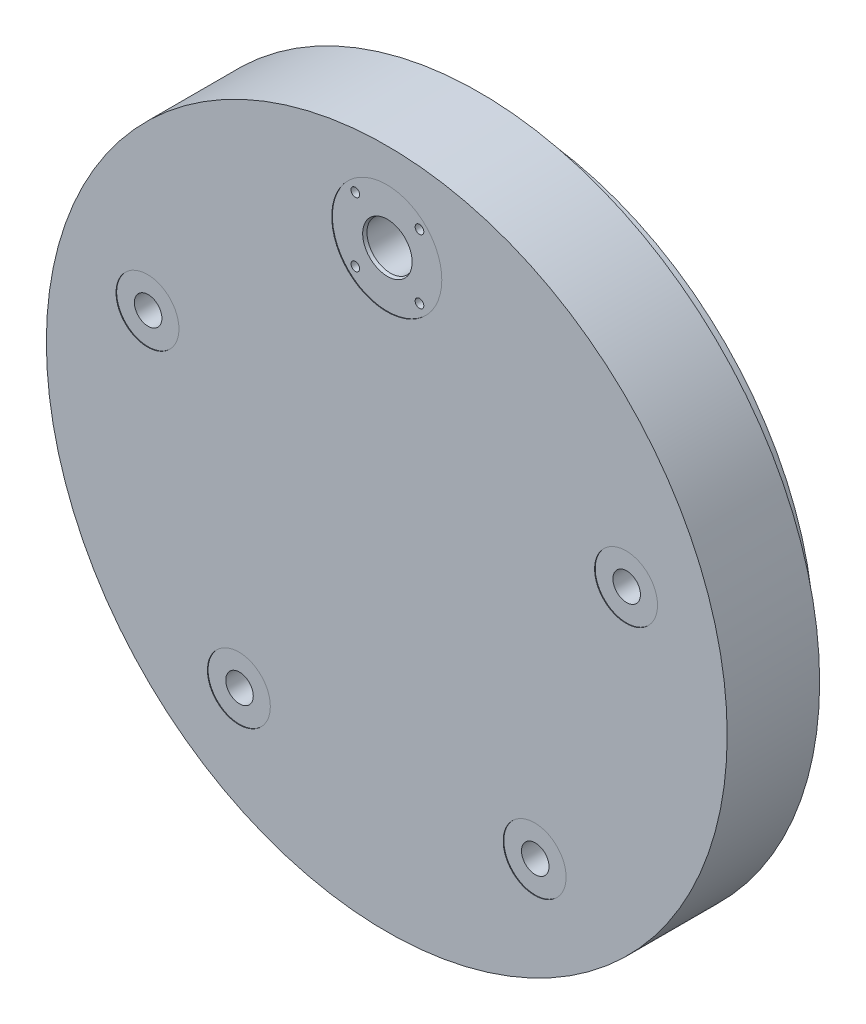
from build123d import *

# Parameters (mm, degrees)
F_7_16_20_TAPPED_HOLE1_D        = 11.1125
SKETCH4_R                       = 9.525
CUT_EXTRUDE1_DEPTH              = 201.758380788
F_6_32_TAPPED_HOLE1_D           = 2.7051
F_6_32_TAPPED_HOLE1_DEPTH       = 14.478
F_6_32_TAPPED_HOLE1_CBORE_D     = 3.5052
F_6_32_TAPPED_HOLE1_CBORE_DEPTH = 7.0104
F_6_32_TAPPED_HOLE1_TIP         = 0.81269403
SKETCH7_R                       = 22.225
SKETCH7_R_2                     = 12.7
CUT_EXTRUDE2_DEPTH              = 0.254
CHAMFER1_SIZE                   = 1.27
CHAMFER1_SIZE2                  = 0.462242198


with BuildPart() as part:
    # Sketch1 → Revolve1 (revolve)
    with BuildSketch(Plane(origin=(0, 0, 0), x_dir=(0, 0, -1), z_dir=(1, 0, 0)), mode=Mode.PRIVATE) as revolve1_sk:
        Polygon((0, 137.4775), (0, 0), (50.038, 0), (50.038, 122.555), (37.338, 122.555), (37.338, 137.4775), align=None)
    revolve(revolve1_sk.sketch.rotate(Axis((0, 0, 0), (0, 0, -1)), 90), axis=Axis((0, 0, 0), (0, 0, -1)))

    # 7_16-20 Tapped Hole1 (through all)
    with Locations(Plane.XY):
        with Locations((-96.627342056, 31.396126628), (96.627342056, 31.396126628), (-59.718981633, -82.196126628), (59.718981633, -82.196126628)):
            Hole(F_7_16_20_TAPPED_HOLE1_D / 2)

    # Sketch4 → Cut-Extrude1 (cut, through all)
    with BuildSketch(Plane.XY):
        with Locations((0, 101.6)):
            Circle(SKETCH4_R)
    extrude(amount=-CUT_EXTRUDE1_DEPTH, mode=Mode.SUBTRACT)

    # 6-32 Tapped Hole1
    with Locations(Plane.XY):
        with Locations((-12.954, 114.554), (12.954, 114.554), (-12.954, 88.646), (12.954, 88.646)):
            CounterBoreHole(F_6_32_TAPPED_HOLE1_D / 2, F_6_32_TAPPED_HOLE1_CBORE_D / 2, F_6_32_TAPPED_HOLE1_CBORE_DEPTH, depth=F_6_32_TAPPED_HOLE1_DEPTH)
            with Locations((0, 0, -(F_6_32_TAPPED_HOLE1_DEPTH + F_6_32_TAPPED_HOLE1_TIP / 2))):  # 118° drill point
                Cone(0, F_6_32_TAPPED_HOLE1_D / 2, F_6_32_TAPPED_HOLE1_TIP, mode=Mode.SUBTRACT)

    # Sketch7 → Cut-Extrude2 (cut)
    with BuildSketch(Plane.XY):
        with Locations((0, 101.6)):
            Circle(SKETCH7_R)
        with Locations((-59.718981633, -82.196126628)):
            Circle(SKETCH7_R_2)
        with Locations((59.718981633, -82.196126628)):
            Circle(SKETCH7_R_2)
        with Locations((96.627342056, 31.396126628)):
            Circle(SKETCH7_R_2)
        with Locations((-96.627342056, 31.396126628)):
            Circle(SKETCH7_R_2)
    extrude(amount=-CUT_EXTRUDE2_DEPTH, mode=Mode.SUBTRACT)

    # Chamfer1
    chamfer1_edges = [part.edges().sort_by_distance(p)[0] for p in [
        (-9.525, 101.6, -0.254),
    ]]
    chamfer1_side = [part.faces().sort_by_distance(p)[0] for p in [
        (-9.525, 101.6, -25.146),
    ]]
    chamfer(chamfer1_edges, length=CHAMFER1_SIZE, length2=CHAMFER1_SIZE2, reference=chamfer1_side[0])


solid = part.part
